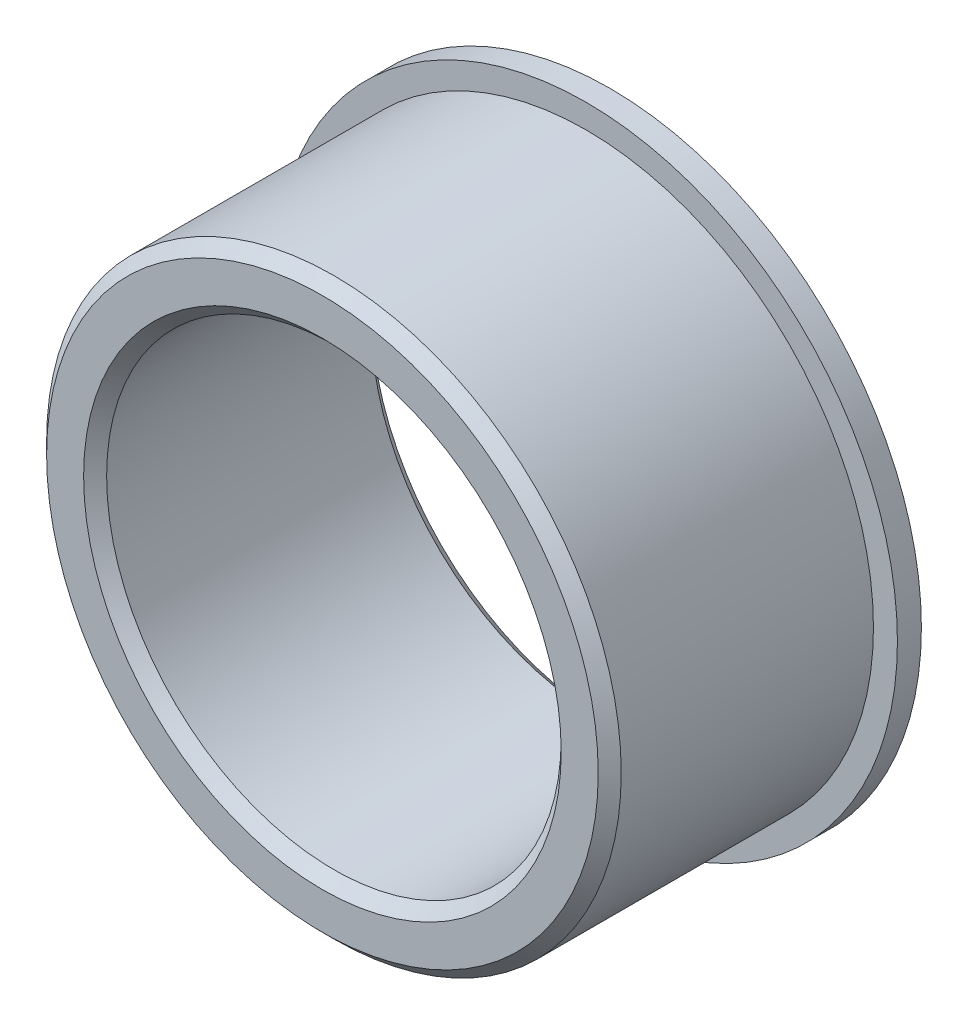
from build123d import *

# Parameters (mm, degrees)
CHAMFER1_SIZE = 0.762


with BuildPart() as part:
    # Sketch1 → Revolve1 (revolve)
    with BuildSketch(Plane(origin=(0, 0, 0), x_dir=(0, 0, -1), z_dir=(1, 0, 0)), mode=Mode.PRIVATE) as revolve1_sk:
        Polygon((19.05, 20.6125), (17.4625, 20.6125), (17.4625, 19.025), (0, 19.025), (0, 15.05), (19.05, 15.05), align=None)
    revolve(revolve1_sk.sketch.rotate(Axis((0, 0, 0), (0, 0, -1)), 90), axis=Axis((0, 0, 0), (0, 0, -1)))

    # Chamfer1
    chamfer1_edges = [part.edges().sort_by_distance(p)[0] for p in [
        (-15.05, 0, -19.05),
        (-15.05, 0, 0),
        (-19.025, 0, 0),
    ]]
    chamfer(chamfer1_edges, length=CHAMFER1_SIZE)


solid = part.part
